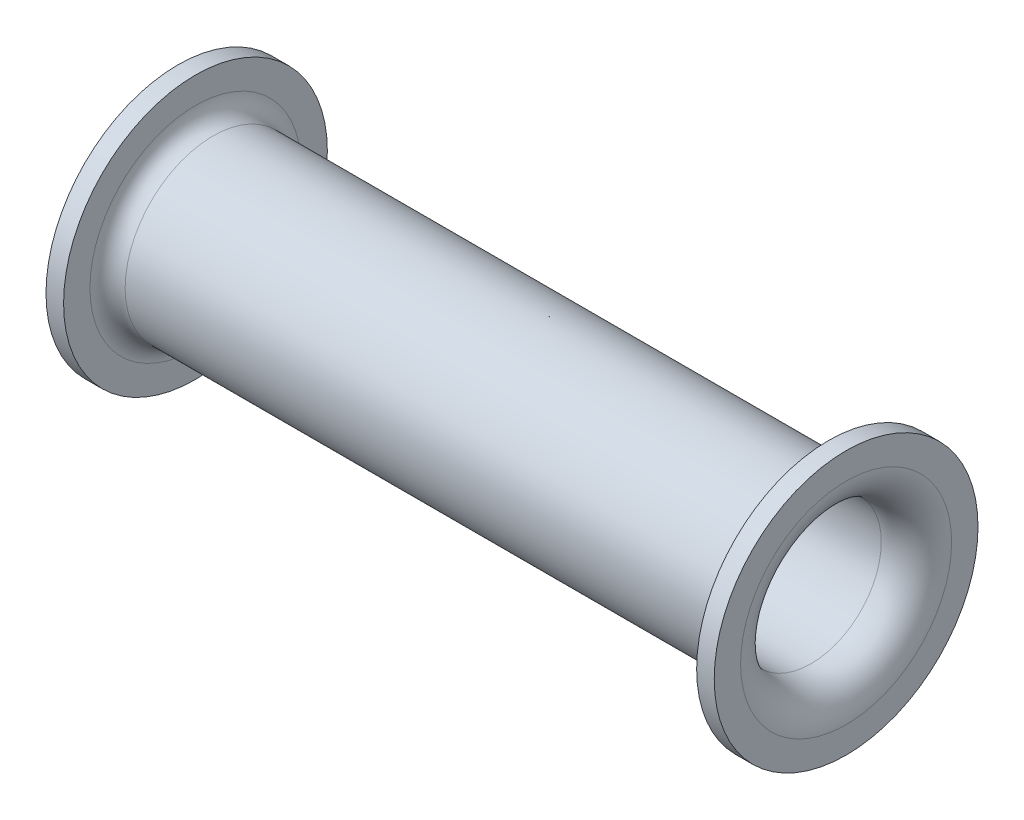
from build123d import *

# Parameters (mm, degrees)
SKETCH1_W = 40
SKETCH1_H = 1
SKETCH2_W = 3
SKETCH2_H = 6


with BuildPart() as part:
    # Sketch1 → Base-Revolve (revolve)
    with BuildSketch(Plane.XY, mode=Mode.PRIVATE) as base_revolve_sk:
        with Locations((0, 4.5)):
            Rectangle(SKETCH1_W, SKETCH1_H)
    revolve(base_revolve_sk.sketch.rotate(Axis((-20, 0, 0), (1, 0, 0)), 90), axis=Axis((-20, 0, 0), (1, 0, 0)))

    # Sketch2 → Cut-for-GripLength (revolve, cut)
    with BuildSketch(Plane.XY):
        with Locations((-18.5, 3)):
            Rectangle(SKETCH2_W, SKETCH2_H)
        with Locations((18.5, 3)):
            Rectangle(SKETCH2_W, SKETCH2_H)
    revolve(axis=Axis((-30, 0, 0), (1, 0, 0)), mode=Mode.SUBTRACT)

    # Sketch3 → HeadTypeA (revolve)
    with BuildSketch(Plane.XY, mode=Mode.PRIVATE) as headtypea_sk:
        with BuildLine():
            Line((-19, 6), (-19, 7.5))
            Line((-19, 7.5), (-18, 7.5))
            Line((-18, 7.5), (-18, 6))
            ThreePointArc((-18, 6), (-17.707106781, 5.292893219), (-17, 5))
            Line((-17, 5), (-17, 4))
            ThreePointArc((-17, 4), (-18.414213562, 4.585786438), (-19, 6))
        make_face()
        with BuildLine():
            Line((19, 6), (19, 7.5))
            Line((19, 7.5), (18, 7.5))
            Line((18, 7.5), (18, 6))
            ThreePointArc((18, 6), (17.707106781, 5.292893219), (17, 5))
            Line((17, 5), (17, 4))
            ThreePointArc((17, 4), (18.414213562, 4.585786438), (19, 6))
        make_face()
    revolve(headtypea_sk.sketch.rotate(Axis((-20, 0, 0), (1, 0, 0)), 90), axis=Axis((-20, 0, 0), (1, 0, 0)))


solid = part.part
